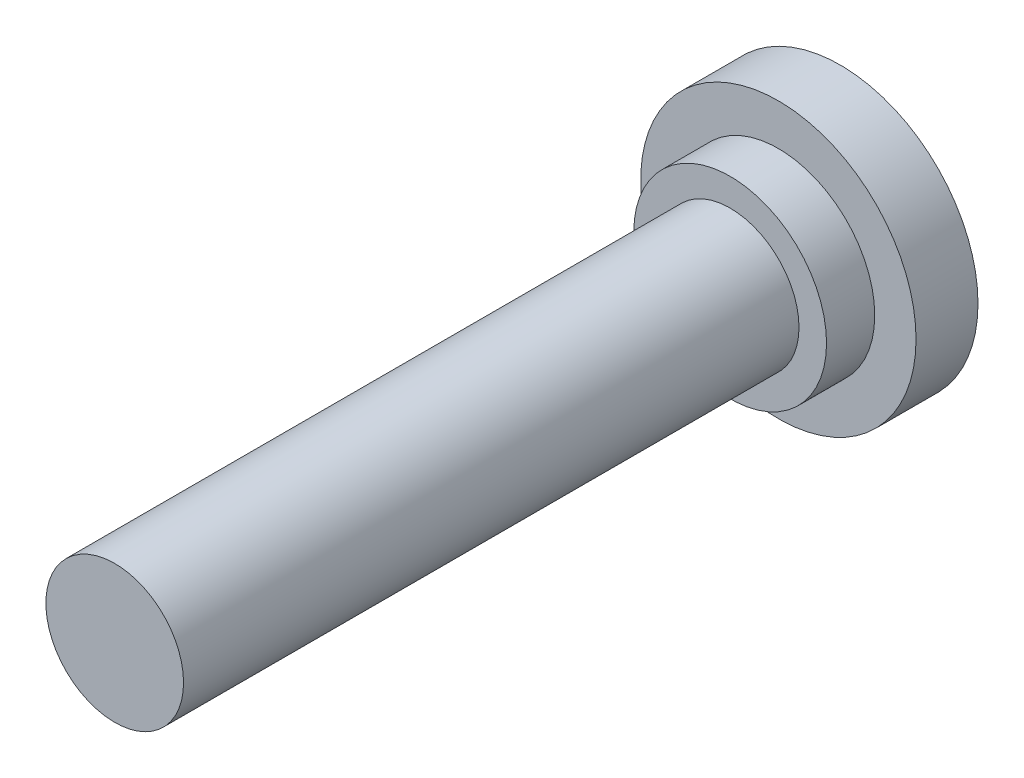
ISO-10303-21;
HEADER;
FILE_DESCRIPTION(('STEP AP214'),'2;1');
FILE_NAME('part.step','',(''),(''),'','','');
FILE_SCHEMA(('AUTOMOTIVE_DESIGN { 1 0 10303 214 1 1 1 1 }'));
ENDSEC;
DATA;
#1=APPLICATION_CONTEXT('core data for automotive mechanical design processes');
#2=APPLICATION_PROTOCOL_DEFINITION('international standard','automotive_design',2000,#1);
#3=PRODUCT_CONTEXT('',#1,'mechanical');
#4=PRODUCT('Part','Part','',(#3));
#5=PRODUCT_RELATED_PRODUCT_CATEGORY('part','',(#4));
#6=PRODUCT_DEFINITION_FORMATION('','',#4);
#7=PRODUCT_DEFINITION_CONTEXT('part definition',#1,'design');
#8=PRODUCT_DEFINITION('design','',#6,#7);
#9=PRODUCT_DEFINITION_SHAPE('','',#8);
#10=(LENGTH_UNIT() NAMED_UNIT(*) SI_UNIT(.MILLI.,.METRE.));
#11=(NAMED_UNIT(*) PLANE_ANGLE_UNIT() SI_UNIT($,.RADIAN.));
#12=(NAMED_UNIT(*) SI_UNIT($,.STERADIAN.) SOLID_ANGLE_UNIT());
#13=UNCERTAINTY_MEASURE_WITH_UNIT(LENGTH_MEASURE(1.E-05),#10,'distance_accuracy_value','');
#14=(GEOMETRIC_REPRESENTATION_CONTEXT(3) GLOBAL_UNCERTAINTY_ASSIGNED_CONTEXT((#13)) GLOBAL_UNIT_ASSIGNED_CONTEXT((#10,
#11,#12)) REPRESENTATION_CONTEXT('',''));
#15=CARTESIAN_POINT('',(0.,0.,0.));
#16=DIRECTION('',(0.,0.,1.));
#17=DIRECTION('',(1.,0.,0.));
#18=AXIS2_PLACEMENT_3D('',#15,#16,#17);
#19=CARTESIAN_POINT('',(0.,0.,105.4));
#20=DIRECTION('',(0.,0.,1.));
#21=DIRECTION('',(1.,0.,0.));
#22=AXIS2_PLACEMENT_3D('',#19,#20,#21);
#23=PLANE('',#22);
#24=CARTESIAN_POINT('',(0.,0.,105.4));
#25=DIRECTION('',(0.,0.,1.));
#26=DIRECTION('',(1.,0.,0.));
#27=AXIS2_PLACEMENT_3D('',#24,#25,#26);
#28=CIRCLE('',#27,10.);
#29=CARTESIAN_POINT('',(10.,0.,105.4));
#30=VERTEX_POINT('',#29);
#31=EDGE_CURVE('E8',#30,#30,#28,.T.);
#32=ORIENTED_EDGE('',*,*,#31,.T.);
#33=EDGE_LOOP('',(#32));
#34=FACE_BOUND('',#33,.T.);
#35=ADVANCED_FACE('F12',(#34),#23,.T.);
#36=CARTESIAN_POINT('',(0.,0.,30.));
#37=DIRECTION('',(0.,0.,1.));
#38=DIRECTION('',(1.,0.,0.));
#39=AXIS2_PLACEMENT_3D('',#36,#37,#38);
#40=CYLINDRICAL_SURFACE('',#39,10.);
#41=CARTESIAN_POINT('',(0.,0.,16.));
#42=DIRECTION('',(0.,0.,1.));
#43=DIRECTION('',(1.,0.,0.));
#44=AXIS2_PLACEMENT_3D('',#41,#42,#43);
#45=CIRCLE('',#44,10.);
#46=CARTESIAN_POINT('',(10.,0.,16.));
#47=VERTEX_POINT('',#46);
#48=EDGE_CURVE('E18',#47,#47,#45,.T.);
#49=ORIENTED_EDGE('',*,*,#48,.T.);
#50=EDGE_LOOP('',(#49));
#51=FACE_BOUND('',#50,.T.);
#52=ORIENTED_EDGE('',*,*,#31,.F.);
#53=EDGE_LOOP('',(#52));
#54=FACE_BOUND('',#53,.T.);
#55=ADVANCED_FACE('F52',(#51,#54),#40,.T.);
#56=CARTESIAN_POINT('',(-10.,0.,16.));
#57=DIRECTION('',(0.,0.,1.));
#58=DIRECTION('',(1.,0.,0.));
#59=AXIS2_PLACEMENT_3D('',#56,#57,#58);
#60=PLANE('',#59);
#61=CARTESIAN_POINT('',(0.,0.,16.));
#62=DIRECTION('',(0.,0.,1.));
#63=DIRECTION('',(1.,0.,0.));
#64=AXIS2_PLACEMENT_3D('',#61,#62,#63);
#65=CIRCLE('',#64,14.);
#66=CARTESIAN_POINT('',(14.,0.,16.));
#67=VERTEX_POINT('',#66);
#68=EDGE_CURVE('E22',#67,#67,#65,.T.);
#69=ORIENTED_EDGE('',*,*,#68,.T.);
#70=EDGE_LOOP('',(#69));
#71=FACE_BOUND('',#70,.T.);
#72=ORIENTED_EDGE('',*,*,#48,.F.);
#73=EDGE_LOOP('',(#72));
#74=FACE_BOUND('',#73,.T.);
#75=ADVANCED_FACE('F57',(#71,#74),#60,.T.);
#76=CARTESIAN_POINT('',(0.,0.,30.));
#77=DIRECTION('',(0.,0.,1.));
#78=DIRECTION('',(1.,0.,0.));
#79=AXIS2_PLACEMENT_3D('',#76,#77,#78);
#80=CYLINDRICAL_SURFACE('',#79,14.);
#81=CARTESIAN_POINT('',(0.,0.,9.));
#82=DIRECTION('',(0.,0.,1.));
#83=DIRECTION('',(1.,0.,0.));
#84=AXIS2_PLACEMENT_3D('',#81,#82,#83);
#85=CIRCLE('',#84,14.);
#86=CARTESIAN_POINT('',(14.,0.,9.));
#87=VERTEX_POINT('',#86);
#88=EDGE_CURVE('E26',#87,#87,#85,.T.);
#89=ORIENTED_EDGE('',*,*,#88,.T.);
#90=EDGE_LOOP('',(#89));
#91=FACE_BOUND('',#90,.T.);
#92=ORIENTED_EDGE('',*,*,#68,.F.);
#93=EDGE_LOOP('',(#92));
#94=FACE_BOUND('',#93,.T.);
#95=ADVANCED_FACE('F62',(#91,#94),#80,.T.);
#96=CARTESIAN_POINT('',(-14.,0.,9.));
#97=DIRECTION('',(0.,0.,1.));
#98=DIRECTION('',(1.,0.,0.));
#99=AXIS2_PLACEMENT_3D('',#96,#97,#98);
#100=PLANE('',#99);
#101=CARTESIAN_POINT('',(0.,0.,9.));
#102=DIRECTION('',(0.,0.,1.));
#103=DIRECTION('',(1.,0.,0.));
#104=AXIS2_PLACEMENT_3D('',#101,#102,#103);
#105=CIRCLE('',#104,20.);
#106=CARTESIAN_POINT('',(20.,0.,9.));
#107=VERTEX_POINT('',#106);
#108=EDGE_CURVE('E31',#107,#107,#105,.T.);
#109=ORIENTED_EDGE('',*,*,#108,.T.);
#110=EDGE_LOOP('',(#109));
#111=FACE_BOUND('',#110,.T.);
#112=ORIENTED_EDGE('',*,*,#88,.F.);
#113=EDGE_LOOP('',(#112));
#114=FACE_BOUND('',#113,.T.);
#115=ADVANCED_FACE('F49',(#111,#114),#100,.T.);
#116=CARTESIAN_POINT('',(0.,0.,30.));
#117=DIRECTION('',(0.,0.,1.));
#118=DIRECTION('',(1.,0.,0.));
#119=AXIS2_PLACEMENT_3D('',#116,#117,#118);
#120=CYLINDRICAL_SURFACE('',#119,20.);
#121=CARTESIAN_POINT('',(0.,0.,0.));
#122=DIRECTION('',(0.,0.,1.));
#123=DIRECTION('',(1.,0.,0.));
#124=AXIS2_PLACEMENT_3D('',#121,#122,#123);
#125=CIRCLE('',#124,20.);
#126=CARTESIAN_POINT('',(20.,0.,0.));
#127=VERTEX_POINT('',#126);
#128=EDGE_CURVE('E34',#127,#127,#125,.T.);
#129=ORIENTED_EDGE('',*,*,#128,.T.);
#130=EDGE_LOOP('',(#129));
#131=FACE_BOUND('',#130,.T.);
#132=ORIENTED_EDGE('',*,*,#108,.F.);
#133=EDGE_LOOP('',(#132));
#134=FACE_BOUND('',#133,.T.);
#135=ADVANCED_FACE('F38',(#131,#134),#120,.T.);
#136=CARTESIAN_POINT('',(-20.,0.,0.));
#137=DIRECTION('',(0.,0.,-1.));
#138=DIRECTION('',(-1.,0.,0.));
#139=AXIS2_PLACEMENT_3D('',#136,#137,#138);
#140=PLANE('',#139);
#141=ORIENTED_EDGE('',*,*,#128,.F.);
#142=EDGE_LOOP('',(#141));
#143=FACE_BOUND('',#142,.T.);
#144=ADVANCED_FACE('F41',(#143),#140,.T.);
#145=CLOSED_SHELL('',(#35,#55,#75,#95,#115,#135,#144));
#146=MANIFOLD_SOLID_BREP('B1',#145);
#147=ADVANCED_BREP_SHAPE_REPRESENTATION('',(#18,#146),#14);
#148=SHAPE_DEFINITION_REPRESENTATION(#9,#147);
ENDSEC;
END-ISO-10303-21;
